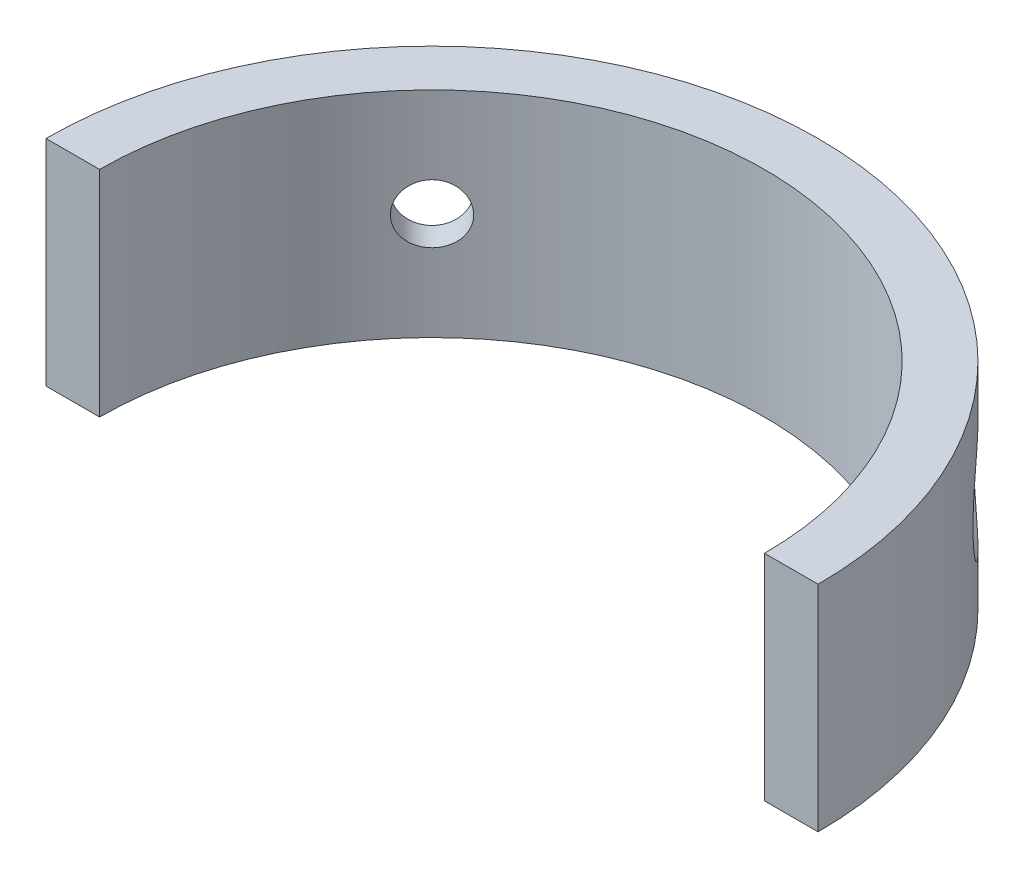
from build123d import *

# Parameters (mm, degrees)
BOSS_EXTRU_1_DEPTH                             = 20
FRAISAGE_POUR_VIS_T_TE_FRAIS_E_M51_D           = 5.5
FRAISAGE_POUR_VIS_T_TE_FRAIS_E_M51_CSINK_D     = 10.4
FRAISAGE_POUR_VIS_T_TE_FRAIS_E_M51_CSINK_ANGLE = 90
R_P_TITION_CIRCULAIRE1_COUNT                   = 2
R_P_TITION_CIRCULAIRE1_ANGLE                   = 90


with BuildPart() as part:
    # Esquisse1 → Boss.-Extru.1 (new body)
    with BuildSketch(Plane(origin=(0, 0, 0), x_dir=(1, 0, 0), z_dir=(0, 1, 0))):
        with BuildLine():
            Line((-36, 0), (-31, 0))
            ThreePointArc((-31, 0), (0, 31), (31, 0))
            Line((31, 0), (36, 0))
            ThreePointArc((36, 0), (0, 36), (-36, 0))
        make_face()
    extrude(amount=BOSS_EXTRU_1_DEPTH)

    # Fraisage pour vis _ t_te frais_e M51 (through all)
    with Locations(Plane(origin=(-25.455844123, 10, -25.455844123), x_dir=(0.707106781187, 0, -0.707106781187), z_dir=(-0.707106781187, 0, -0.707106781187))):
        with Locations((0, 0)):
            fraisage_pour_vis_t_te_frais_e_m51 = CounterSinkHole(FRAISAGE_POUR_VIS_T_TE_FRAIS_E_M51_D / 2, FRAISAGE_POUR_VIS_T_TE_FRAIS_E_M51_CSINK_D / 2, counter_sink_angle=FRAISAGE_POUR_VIS_T_TE_FRAIS_E_M51_CSINK_ANGLE)

    # R_p_tition circulaire1: Fraisage pour vis _ t_te frais_e M51 ×2 about axis
    r_p_tition_circulaire1_axis = Axis((0, 20, 0), (0, -1, 0))
    for i in range(1, R_P_TITION_CIRCULAIRE1_COUNT):
        add(fraisage_pour_vis_t_te_frais_e_m51.rotate(r_p_tition_circulaire1_axis, i * R_P_TITION_CIRCULAIRE1_ANGLE / (R_P_TITION_CIRCULAIRE1_COUNT - 1)), mode=Mode.SUBTRACT)


solid = part.part
